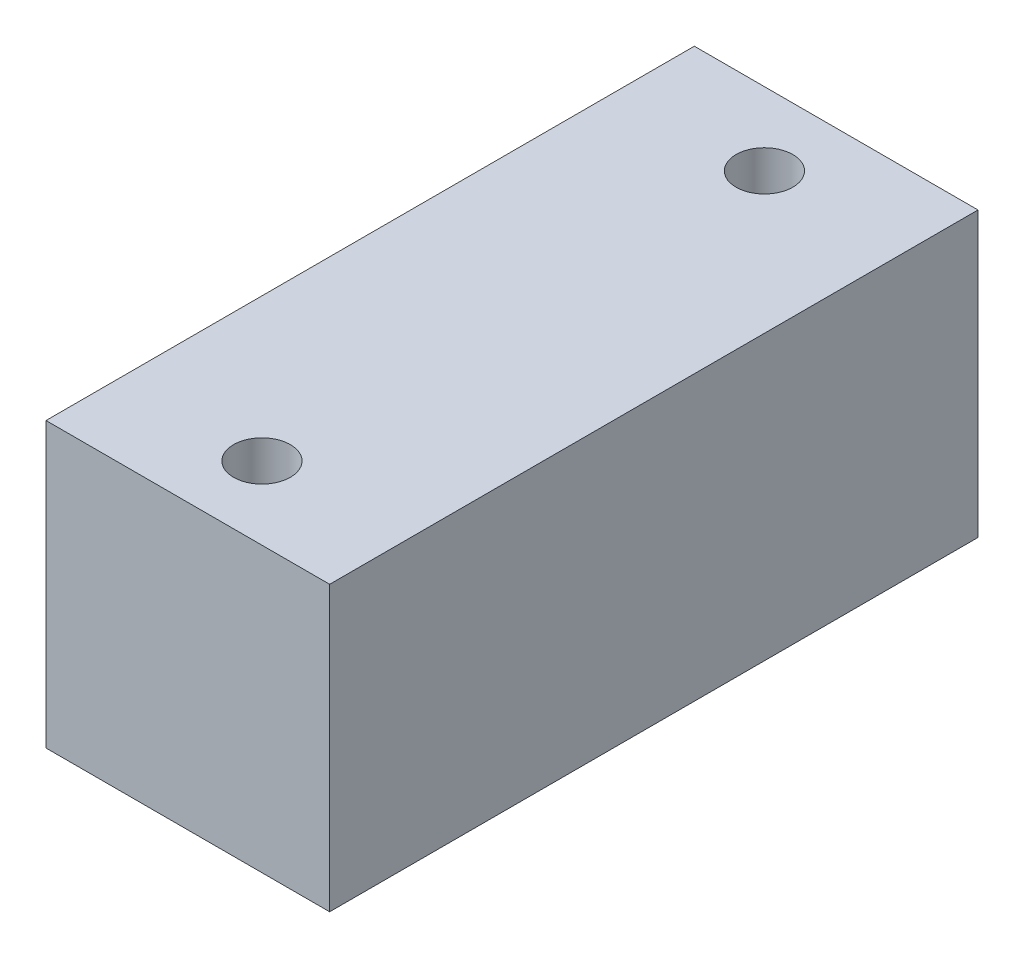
ISO-10303-21;
HEADER;
FILE_DESCRIPTION(('STEP AP214'),'2;1');
FILE_NAME('part.step','',(''),(''),'','','');
FILE_SCHEMA(('AUTOMOTIVE_DESIGN { 1 0 10303 214 1 1 1 1 }'));
ENDSEC;
DATA;
#1=APPLICATION_CONTEXT('core data for automotive mechanical design processes');
#2=APPLICATION_PROTOCOL_DEFINITION('international standard','automotive_design',2000,#1);
#3=PRODUCT_CONTEXT('',#1,'mechanical');
#4=PRODUCT('Part','Part','',(#3));
#5=PRODUCT_RELATED_PRODUCT_CATEGORY('part','',(#4));
#6=PRODUCT_DEFINITION_FORMATION('','',#4);
#7=PRODUCT_DEFINITION_CONTEXT('part definition',#1,'design');
#8=PRODUCT_DEFINITION('design','',#6,#7);
#9=PRODUCT_DEFINITION_SHAPE('','',#8);
#10=(LENGTH_UNIT() NAMED_UNIT(*) SI_UNIT(.MILLI.,.METRE.));
#11=(NAMED_UNIT(*) PLANE_ANGLE_UNIT() SI_UNIT($,.RADIAN.));
#12=(NAMED_UNIT(*) SI_UNIT($,.STERADIAN.) SOLID_ANGLE_UNIT());
#13=UNCERTAINTY_MEASURE_WITH_UNIT(LENGTH_MEASURE(1.E-05),#10,'distance_accuracy_value','');
#14=(GEOMETRIC_REPRESENTATION_CONTEXT(3) GLOBAL_UNCERTAINTY_ASSIGNED_CONTEXT((#13)) GLOBAL_UNIT_ASSIGNED_CONTEXT((#10,
#11,#12)) REPRESENTATION_CONTEXT('',''));
#15=CARTESIAN_POINT('',(0.,0.,0.));
#16=DIRECTION('',(0.,0.,1.));
#17=DIRECTION('',(1.,0.,0.));
#18=AXIS2_PLACEMENT_3D('',#15,#16,#17);
#19=CARTESIAN_POINT('',(0.,0.,80.));
#20=DIRECTION('',(1.,0.,0.));
#21=DIRECTION('',(0.,0.,-1.));
#22=AXIS2_PLACEMENT_3D('',#19,#20,#21);
#23=PLANE('',#22);
#24=DIRECTION('',(0.,-1.,0.));
#25=VECTOR('',#24,1.);
#26=CARTESIAN_POINT('',(0.,0.,0.));
#27=LINE('',#26,#25);
#28=CARTESIAN_POINT('',(0.,35.,0.));
#29=VERTEX_POINT('',#28);
#30=CARTESIAN_POINT('',(0.,0.,0.));
#31=VERTEX_POINT('',#30);
#32=EDGE_CURVE('E76',#29,#31,#27,.T.);
#33=ORIENTED_EDGE('',*,*,#32,.T.);
#34=DIRECTION('',(0.,0.,-1.));
#35=VECTOR('',#34,1.);
#36=CARTESIAN_POINT('',(0.,0.,80.));
#37=LINE('',#36,#35);
#38=CARTESIAN_POINT('',(0.,0.,80.));
#39=VERTEX_POINT('',#38);
#40=EDGE_CURVE('E11',#39,#31,#37,.T.);
#41=ORIENTED_EDGE('',*,*,#40,.F.);
#42=DIRECTION('',(0.,-1.,0.));
#43=VECTOR('',#42,1.);
#44=CARTESIAN_POINT('',(0.,0.,80.));
#45=LINE('',#44,#43);
#46=CARTESIAN_POINT('',(0.,35.,80.));
#47=VERTEX_POINT('',#46);
#48=EDGE_CURVE('E99',#47,#39,#45,.T.);
#49=ORIENTED_EDGE('',*,*,#48,.F.);
#50=DIRECTION('',(0.,0.,-1.));
#51=VECTOR('',#50,1.);
#52=CARTESIAN_POINT('',(0.,35.,80.));
#53=LINE('',#52,#51);
#54=EDGE_CURVE('E88',#47,#29,#53,.T.);
#55=ORIENTED_EDGE('',*,*,#54,.T.);
#56=EDGE_LOOP('',(#33,#41,#49,#55));
#57=FACE_BOUND('',#56,.T.);
#58=ADVANCED_FACE('F32',(#57),#23,.F.);
#59=CARTESIAN_POINT('',(0.,0.,80.));
#60=DIRECTION('',(0.,1.,0.));
#61=DIRECTION('',(0.,0.,1.));
#62=AXIS2_PLACEMENT_3D('',#59,#60,#61);
#63=PLANE('',#62);
#64=CARTESIAN_POINT('',(17.645485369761,0.,71.));
#65=DIRECTION('',(0.,1.,0.));
#66=DIRECTION('',(0.,0.,1.));
#67=AXIS2_PLACEMENT_3D('',#64,#65,#66);
#68=CIRCLE('',#67,3.50000000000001);
#69=CARTESIAN_POINT('',(17.645485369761,0.,74.5));
#70=VERTEX_POINT('',#69);
#71=EDGE_CURVE('E134',#70,#70,#68,.T.);
#72=ORIENTED_EDGE('',*,*,#71,.T.);
#73=EDGE_LOOP('',(#72));
#74=FACE_BOUND('',#73,.T.);
#75=CARTESIAN_POINT('',(17.645485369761,0.,9.));
#76=DIRECTION('',(0.,1.,0.));
#77=DIRECTION('',(0.,0.,1.));
#78=AXIS2_PLACEMENT_3D('',#75,#76,#77);
#79=CIRCLE('',#78,3.5);
#80=CARTESIAN_POINT('',(17.645485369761,0.,12.5));
#81=VERTEX_POINT('',#80);
#82=EDGE_CURVE('E89',#81,#81,#79,.T.);
#83=ORIENTED_EDGE('',*,*,#82,.T.);
#84=EDGE_LOOP('',(#83));
#85=FACE_BOUND('',#84,.T.);
#86=DIRECTION('',(1.,0.,0.));
#87=VECTOR('',#86,1.);
#88=CARTESIAN_POINT('',(0.,0.,0.));
#89=LINE('',#88,#87);
#90=CARTESIAN_POINT('',(35.,0.,0.));
#91=VERTEX_POINT('',#90);
#92=EDGE_CURVE('E72',#31,#91,#89,.T.);
#93=ORIENTED_EDGE('',*,*,#92,.T.);
#94=DIRECTION('',(0.,0.,-1.));
#95=VECTOR('',#94,1.);
#96=CARTESIAN_POINT('',(35.,0.,80.));
#97=LINE('',#96,#95);
#98=CARTESIAN_POINT('',(35.,0.,80.));
#99=VERTEX_POINT('',#98);
#100=EDGE_CURVE('E39',#99,#91,#97,.T.);
#101=ORIENTED_EDGE('',*,*,#100,.F.);
#102=DIRECTION('',(1.,0.,0.));
#103=VECTOR('',#102,1.);
#104=CARTESIAN_POINT('',(0.,0.,80.));
#105=LINE('',#104,#103);
#106=EDGE_CURVE('E84',#39,#99,#105,.T.);
#107=ORIENTED_EDGE('',*,*,#106,.F.);
#108=ORIENTED_EDGE('',*,*,#40,.T.);
#109=EDGE_LOOP('',(#93,#101,#107,#108));
#110=FACE_BOUND('',#109,.T.);
#111=ADVANCED_FACE('F83',(#74,#85,#110),#63,.F.);
#112=CARTESIAN_POINT('',(35.,0.,80.));
#113=DIRECTION('',(-1.,0.,0.));
#114=DIRECTION('',(0.,0.,1.));
#115=AXIS2_PLACEMENT_3D('',#112,#113,#114);
#116=PLANE('',#115);
#117=DIRECTION('',(0.,1.,0.));
#118=VECTOR('',#117,1.);
#119=CARTESIAN_POINT('',(35.,0.,0.));
#120=LINE('',#119,#118);
#121=CARTESIAN_POINT('',(35.,35.,0.));
#122=VERTEX_POINT('',#121);
#123=EDGE_CURVE('E77',#91,#122,#120,.T.);
#124=ORIENTED_EDGE('',*,*,#123,.T.);
#125=DIRECTION('',(0.,0.,-1.));
#126=VECTOR('',#125,1.);
#127=CARTESIAN_POINT('',(35.,35.,80.));
#128=LINE('',#127,#126);
#129=CARTESIAN_POINT('',(35.,35.,80.));
#130=VERTEX_POINT('',#129);
#131=EDGE_CURVE('E105',#130,#122,#128,.T.);
#132=ORIENTED_EDGE('',*,*,#131,.F.);
#133=DIRECTION('',(0.,1.,0.));
#134=VECTOR('',#133,1.);
#135=CARTESIAN_POINT('',(35.,0.,80.));
#136=LINE('',#135,#134);
#137=EDGE_CURVE('E51',#99,#130,#136,.T.);
#138=ORIENTED_EDGE('',*,*,#137,.F.);
#139=ORIENTED_EDGE('',*,*,#100,.T.);
#140=EDGE_LOOP('',(#124,#132,#138,#139));
#141=FACE_BOUND('',#140,.T.);
#142=ADVANCED_FACE('F108',(#141),#116,.F.);
#143=CARTESIAN_POINT('',(0.,35.,80.));
#144=DIRECTION('',(0.,-1.,0.));
#145=DIRECTION('',(0.,0.,-1.));
#146=AXIS2_PLACEMENT_3D('',#143,#144,#145);
#147=PLANE('',#146);
#148=CARTESIAN_POINT('',(17.645485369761,35.,71.));
#149=DIRECTION('',(0.,1.,0.));
#150=DIRECTION('',(0.,0.,1.));
#151=AXIS2_PLACEMENT_3D('',#148,#149,#150);
#152=CIRCLE('',#151,3.50000000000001);
#153=CARTESIAN_POINT('',(17.645485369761,35.,74.5));
#154=VERTEX_POINT('',#153);
#155=EDGE_CURVE('E144',#154,#154,#152,.T.);
#156=ORIENTED_EDGE('',*,*,#155,.F.);
#157=EDGE_LOOP('',(#156));
#158=FACE_BOUND('',#157,.T.);
#159=CARTESIAN_POINT('',(17.645485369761,35.,9.));
#160=DIRECTION('',(0.,1.,0.));
#161=DIRECTION('',(0.,0.,1.));
#162=AXIS2_PLACEMENT_3D('',#159,#160,#161);
#163=CIRCLE('',#162,3.5);
#164=CARTESIAN_POINT('',(17.645485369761,35.,12.5));
#165=VERTEX_POINT('',#164);
#166=EDGE_CURVE('E92',#165,#165,#163,.T.);
#167=ORIENTED_EDGE('',*,*,#166,.F.);
#168=EDGE_LOOP('',(#167));
#169=FACE_BOUND('',#168,.T.);
#170=DIRECTION('',(-1.,0.,0.));
#171=VECTOR('',#170,1.);
#172=CARTESIAN_POINT('',(0.,35.,0.));
#173=LINE('',#172,#171);
#174=EDGE_CURVE('E97',#122,#29,#173,.T.);
#175=ORIENTED_EDGE('',*,*,#174,.T.);
#176=ORIENTED_EDGE('',*,*,#54,.F.);
#177=DIRECTION('',(-1.,0.,0.));
#178=VECTOR('',#177,1.);
#179=CARTESIAN_POINT('',(0.,35.,80.));
#180=LINE('',#179,#178);
#181=EDGE_CURVE('E46',#130,#47,#180,.T.);
#182=ORIENTED_EDGE('',*,*,#181,.F.);
#183=ORIENTED_EDGE('',*,*,#131,.T.);
#184=EDGE_LOOP('',(#175,#176,#182,#183));
#185=FACE_BOUND('',#184,.T.);
#186=ADVANCED_FACE('F110',(#158,#169,#185),#147,.F.);
#187=CARTESIAN_POINT('',(0.,35.,80.));
#188=DIRECTION('',(0.,0.,-1.));
#189=DIRECTION('',(-1.,0.,0.));
#190=AXIS2_PLACEMENT_3D('',#187,#188,#189);
#191=PLANE('',#190);
#192=ORIENTED_EDGE('',*,*,#48,.T.);
#193=ORIENTED_EDGE('',*,*,#106,.T.);
#194=ORIENTED_EDGE('',*,*,#137,.T.);
#195=ORIENTED_EDGE('',*,*,#181,.T.);
#196=EDGE_LOOP('',(#192,#193,#194,#195));
#197=FACE_BOUND('',#196,.T.);
#198=ADVANCED_FACE('F111',(#197),#191,.F.);
#199=CARTESIAN_POINT('',(0.,35.,0.));
#200=DIRECTION('',(0.,0.,-1.));
#201=DIRECTION('',(-1.,0.,0.));
#202=AXIS2_PLACEMENT_3D('',#199,#200,#201);
#203=PLANE('',#202);
#204=ORIENTED_EDGE('',*,*,#32,.F.);
#205=ORIENTED_EDGE('',*,*,#174,.F.);
#206=ORIENTED_EDGE('',*,*,#123,.F.);
#207=ORIENTED_EDGE('',*,*,#92,.F.);
#208=EDGE_LOOP('',(#204,#205,#206,#207));
#209=FACE_BOUND('',#208,.T.);
#210=ADVANCED_FACE('F73',(#209),#203,.T.);
#211=CARTESIAN_POINT('',(17.645485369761,0.,9.));
#212=DIRECTION('',(0.,1.,0.));
#213=DIRECTION('',(0.,0.,1.));
#214=AXIS2_PLACEMENT_3D('',#211,#212,#213);
#215=CYLINDRICAL_SURFACE('',#214,3.5);
#216=ORIENTED_EDGE('',*,*,#82,.F.);
#217=EDGE_LOOP('',(#216));
#218=FACE_BOUND('',#217,.T.);
#219=ORIENTED_EDGE('',*,*,#166,.T.);
#220=EDGE_LOOP('',(#219));
#221=FACE_BOUND('',#220,.T.);
#222=ADVANCED_FACE('F118',(#218,#221),#215,.F.);
#223=CARTESIAN_POINT('',(17.645485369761,0.,71.));
#224=DIRECTION('',(0.,1.,0.));
#225=DIRECTION('',(0.,0.,1.));
#226=AXIS2_PLACEMENT_3D('',#223,#224,#225);
#227=CYLINDRICAL_SURFACE('',#226,3.50000000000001);
#228=ORIENTED_EDGE('',*,*,#71,.F.);
#229=EDGE_LOOP('',(#228));
#230=FACE_BOUND('',#229,.T.);
#231=ORIENTED_EDGE('',*,*,#155,.T.);
#232=EDGE_LOOP('',(#231));
#233=FACE_BOUND('',#232,.T.);
#234=ADVANCED_FACE('F139',(#230,#233),#227,.F.);
#235=CLOSED_SHELL('',(#58,#111,#142,#186,#198,#210,#222,#234));
#236=MANIFOLD_SOLID_BREP('B2',#235);
#237=ADVANCED_BREP_SHAPE_REPRESENTATION('',(#18,#236),#14);
#238=SHAPE_DEFINITION_REPRESENTATION(#9,#237);
ENDSEC;
END-ISO-10303-21;
